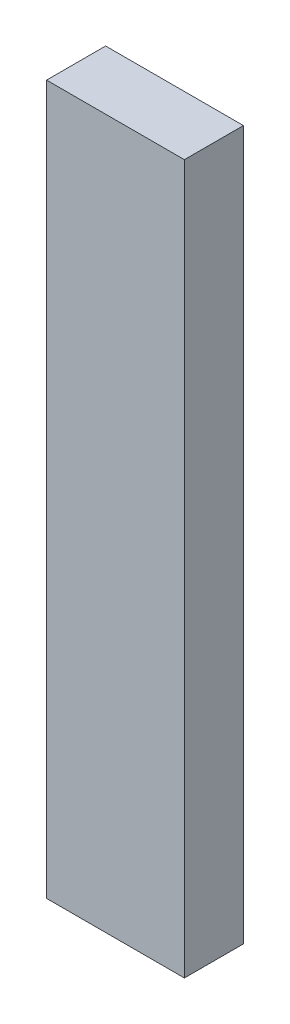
from build123d import *

# Parameters (mm, degrees)
SKETCH1_W           = 88.9
SKETCH1_H           = 38.1
BOSS_EXTRUDE1_DEPTH = 457.2


with BuildPart() as part:
    # Sketch1 → Boss-Extrude1 (new body)
    with BuildSketch(Plane(origin=(0, 0, 0), x_dir=(1, 0, 0), z_dir=(0, 1, 0))):
        with Locations((44.45, 19.05)):
            Rectangle(SKETCH1_W, SKETCH1_H)
    extrude(amount=BOSS_EXTRUDE1_DEPTH)


solid = part.part
